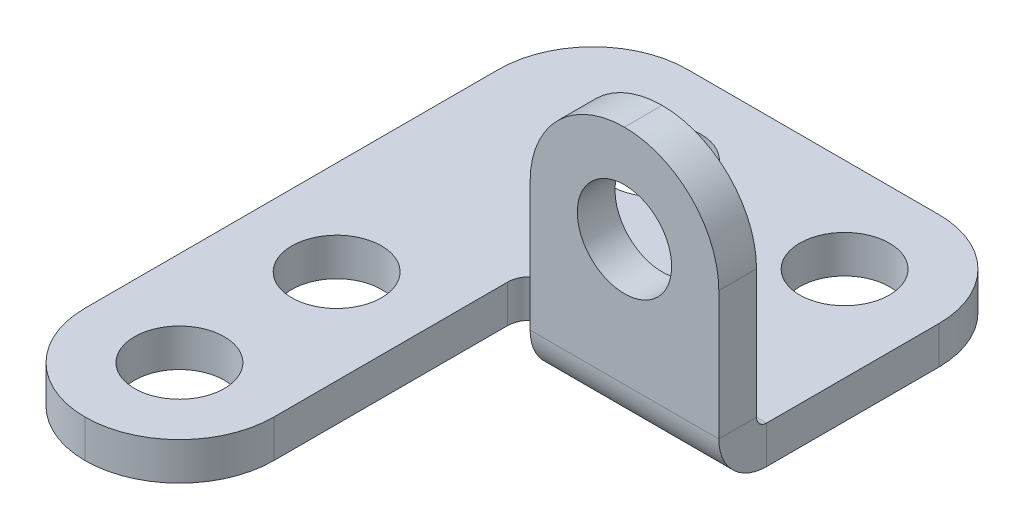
ISO-10303-21;
HEADER;
FILE_DESCRIPTION(('STEP AP214'),'2;1');
FILE_NAME('part.step','',(''),(''),'','','');
FILE_SCHEMA(('AUTOMOTIVE_DESIGN { 1 0 10303 214 1 1 1 1 }'));
ENDSEC;
DATA;
#1=APPLICATION_CONTEXT('core data for automotive mechanical design processes');
#2=APPLICATION_PROTOCOL_DEFINITION('international standard','automotive_design',2000,#1);
#3=PRODUCT_CONTEXT('',#1,'mechanical');
#4=PRODUCT('Part','Part','',(#3));
#5=PRODUCT_RELATED_PRODUCT_CATEGORY('part','',(#4));
#6=PRODUCT_DEFINITION_FORMATION('','',#4);
#7=PRODUCT_DEFINITION_CONTEXT('part definition',#1,'design');
#8=PRODUCT_DEFINITION('design','',#6,#7);
#9=PRODUCT_DEFINITION_SHAPE('','',#8);
#10=(LENGTH_UNIT() NAMED_UNIT(*) SI_UNIT(.MILLI.,.METRE.));
#11=(NAMED_UNIT(*) PLANE_ANGLE_UNIT() SI_UNIT($,.RADIAN.));
#12=(NAMED_UNIT(*) SI_UNIT($,.STERADIAN.) SOLID_ANGLE_UNIT());
#13=UNCERTAINTY_MEASURE_WITH_UNIT(LENGTH_MEASURE(1.E-05),#10,'distance_accuracy_value','');
#14=(GEOMETRIC_REPRESENTATION_CONTEXT(3) GLOBAL_UNCERTAINTY_ASSIGNED_CONTEXT((#13)) GLOBAL_UNIT_ASSIGNED_CONTEXT((#10,
#11,#12)) REPRESENTATION_CONTEXT('',''));
#15=CARTESIAN_POINT('',(0.,0.,0.));
#16=DIRECTION('',(0.,0.,1.));
#17=DIRECTION('',(1.,0.,0.));
#18=AXIS2_PLACEMENT_3D('',#15,#16,#17);
#19=CARTESIAN_POINT('',(0.,-1.905,0.));
#20=DIRECTION('',(0.,-1.,0.));
#21=DIRECTION('',(0.,0.,1.));
#22=AXIS2_PLACEMENT_3D('',#19,#20,#21);
#23=PLANE('',#22);
#24=CARTESIAN_POINT('',(4.7625,-1.905,25.6413));
#25=DIRECTION('',(0.,-1.,0.));
#26=DIRECTION('',(0.,0.,-1.));
#27=AXIS2_PLACEMENT_3D('',#24,#25,#26);
#28=CIRCLE('',#27,2.26695);
#29=CARTESIAN_POINT('',(4.7625,-1.905,23.37435));
#30=VERTEX_POINT('',#29);
#31=EDGE_CURVE('E268',#30,#30,#28,.T.);
#32=ORIENTED_EDGE('',*,*,#31,.F.);
#33=EDGE_LOOP('',(#32));
#34=FACE_BOUND('',#33,.T.);
#35=CARTESIAN_POINT('',(4.7625,-1.905,17.7038));
#36=DIRECTION('',(0.,-1.,0.));
#37=DIRECTION('',(0.,0.,-1.));
#38=AXIS2_PLACEMENT_3D('',#35,#36,#37);
#39=CIRCLE('',#38,2.26695);
#40=CARTESIAN_POINT('',(4.7625,-1.905,15.43685));
#41=VERTEX_POINT('',#40);
#42=EDGE_CURVE('E262',#41,#41,#39,.T.);
#43=ORIENTED_EDGE('',*,*,#42,.F.);
#44=EDGE_LOOP('',(#43));
#45=FACE_BOUND('',#44,.T.);
#46=CARTESIAN_POINT('',(17.4625,-1.905,4.7625));
#47=DIRECTION('',(0.,-1.,0.));
#48=DIRECTION('',(0.,0.,-1.));
#49=AXIS2_PLACEMENT_3D('',#46,#47,#48);
#50=CIRCLE('',#49,2.26695);
#51=CARTESIAN_POINT('',(17.4625,-1.905,2.49555));
#52=VERTEX_POINT('',#51);
#53=EDGE_CURVE('E256',#52,#52,#50,.T.);
#54=ORIENTED_EDGE('',*,*,#53,.F.);
#55=EDGE_LOOP('',(#54));
#56=FACE_BOUND('',#55,.T.);
#57=CARTESIAN_POINT('',(7.9375,-1.905,4.7625));
#58=DIRECTION('',(0.,-1.,0.));
#59=DIRECTION('',(0.,0.,-1.));
#60=AXIS2_PLACEMENT_3D('',#57,#58,#59);
#61=CIRCLE('',#60,2.26695);
#62=CARTESIAN_POINT('',(7.9375,-1.905,2.49555));
#63=VERTEX_POINT('',#62);
#64=EDGE_CURVE('E250',#63,#63,#61,.T.);
#65=ORIENTED_EDGE('',*,*,#64,.F.);
#66=EDGE_LOOP('',(#65));
#67=FACE_BOUND('',#66,.T.);
#68=CARTESIAN_POINT('',(11.557,-1.905,13.843));
#69=DIRECTION('',(0.,-1.,0.));
#70=DIRECTION('',(0.,0.,-1.));
#71=AXIS2_PLACEMENT_3D('',#68,#69,#70);
#72=CIRCLE('',#71,1.143);
#73=CARTESIAN_POINT('',(11.557,-1.905,12.7));
#74=VERTEX_POINT('',#73);
#75=CARTESIAN_POINT('',(12.690475,-1.905,13.6957470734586));
#76=VERTEX_POINT('',#75);
#77=EDGE_CURVE('E274',#74,#76,#72,.T.);
#78=ORIENTED_EDGE('',*,*,#77,.F.);
#79=DIRECTION('',(1.,0.,0.));
#80=VECTOR('',#79,1.);
#81=CARTESIAN_POINT('',(0.,-1.905,12.7));
#82=LINE('',#81,#80);
#83=CARTESIAN_POINT('',(10.668,-1.905,12.7));
#84=VERTEX_POINT('',#83);
#85=EDGE_CURVE('E278',#84,#74,#82,.T.);
#86=ORIENTED_EDGE('',*,*,#85,.F.);
#87=CARTESIAN_POINT('',(10.668,-1.905,13.843));
#88=DIRECTION('',(0.,-1.,0.));
#89=DIRECTION('',(0.,0.,-1.));
#90=AXIS2_PLACEMENT_3D('',#87,#88,#89);
#91=CIRCLE('',#90,1.143);
#92=CARTESIAN_POINT('',(9.525,-1.905,13.843));
#93=VERTEX_POINT('',#92);
#94=EDGE_CURVE('E281',#93,#84,#91,.T.);
#95=ORIENTED_EDGE('',*,*,#94,.F.);
#96=DIRECTION('',(0.,0.,1.));
#97=VECTOR('',#96,1.);
#98=CARTESIAN_POINT('',(9.525,-1.905,30.4038));
#99=LINE('',#98,#97);
#100=CARTESIAN_POINT('',(9.525,-1.905,25.6413));
#101=VERTEX_POINT('',#100);
#102=EDGE_CURVE('E309',#93,#101,#99,.T.);
#103=ORIENTED_EDGE('',*,*,#102,.T.);
#104=CARTESIAN_POINT('',(4.7625,-1.905,25.6413));
#105=DIRECTION('',(0.,1.,0.));
#106=DIRECTION('',(0.,0.,1.));
#107=AXIS2_PLACEMENT_3D('',#104,#105,#106);
#108=CIRCLE('',#107,4.7625);
#109=CARTESIAN_POINT('',(4.7625,-1.905,30.4038));
#110=VERTEX_POINT('',#109);
#111=EDGE_CURVE('E344',#110,#101,#108,.T.);
#112=ORIENTED_EDGE('',*,*,#111,.F.);
#113=CARTESIAN_POINT('',(4.7625,-1.905,25.6413));
#114=DIRECTION('',(0.,1.,0.));
#115=DIRECTION('',(0.,0.,1.));
#116=AXIS2_PLACEMENT_3D('',#113,#114,#115);
#117=CIRCLE('',#116,4.7625);
#118=CARTESIAN_POINT('',(0.,-1.905,25.6413));
#119=VERTEX_POINT('',#118);
#120=EDGE_CURVE('E347',#119,#110,#117,.T.);
#121=ORIENTED_EDGE('',*,*,#120,.F.);
#122=DIRECTION('',(0.,0.,-1.));
#123=VECTOR('',#122,1.);
#124=CARTESIAN_POINT('',(0.,-1.905,0.));
#125=LINE('',#124,#123);
#126=CARTESIAN_POINT('',(0.,-1.905,4.7625));
#127=VERTEX_POINT('',#126);
#128=EDGE_CURVE('E299',#119,#127,#125,.T.);
#129=ORIENTED_EDGE('',*,*,#128,.T.);
#130=CARTESIAN_POINT('',(4.7625,-1.905,4.7625));
#131=DIRECTION('',(0.,1.,0.));
#132=DIRECTION('',(0.,0.,1.));
#133=AXIS2_PLACEMENT_3D('',#130,#131,#132);
#134=CIRCLE('',#133,4.7625);
#135=CARTESIAN_POINT('',(4.7625,-1.905,0.));
#136=VERTEX_POINT('',#135);
#137=EDGE_CURVE('E338',#136,#127,#134,.T.);
#138=ORIENTED_EDGE('',*,*,#137,.F.);
#139=DIRECTION('',(1.,0.,0.));
#140=VECTOR('',#139,1.);
#141=CARTESIAN_POINT('',(0.,-1.905,0.));
#142=LINE('',#141,#140);
#143=CARTESIAN_POINT('',(17.4625,-1.905,0.));
#144=VERTEX_POINT('',#143);
#145=EDGE_CURVE('E302',#136,#144,#142,.T.);
#146=ORIENTED_EDGE('',*,*,#145,.T.);
#147=CARTESIAN_POINT('',(17.4625,-1.905,4.7625));
#148=DIRECTION('',(0.,1.,0.));
#149=DIRECTION('',(0.,0.,1.));
#150=AXIS2_PLACEMENT_3D('',#147,#148,#149);
#151=CIRCLE('',#150,4.7625);
#152=CARTESIAN_POINT('',(22.225,-1.905,4.7625));
#153=VERTEX_POINT('',#152);
#154=EDGE_CURVE('E341',#153,#144,#151,.T.);
#155=ORIENTED_EDGE('',*,*,#154,.F.);
#156=DIRECTION('',(0.,0.,1.));
#157=VECTOR('',#156,1.);
#158=CARTESIAN_POINT('',(22.225,-1.905,0.));
#159=LINE('',#158,#157);
#160=CARTESIAN_POINT('',(22.225,-1.905,13.462));
#161=VERTEX_POINT('',#160);
#162=EDGE_CURVE('E306',#153,#161,#159,.T.);
#163=ORIENTED_EDGE('',*,*,#162,.T.);
#164=DIRECTION('',(-1.,0.,0.));
#165=VECTOR('',#164,1.);
#166=CARTESIAN_POINT('',(12.7,-1.905,13.462));
#167=LINE('',#166,#165);
#168=CARTESIAN_POINT('',(12.7,-1.905,13.462));
#169=VERTEX_POINT('',#168);
#170=EDGE_CURVE('E212',#169,#161,#167,.F.);
#171=ORIENTED_EDGE('',*,*,#170,.F.);
#172=DIRECTION('',(0.,0.,1.));
#173=VECTOR('',#172,1.);
#174=CARTESIAN_POINT('',(12.7,-1.905,0.));
#175=LINE('',#174,#173);
#176=CARTESIAN_POINT('',(12.7,-1.905,13.452475));
#177=VERTEX_POINT('',#176);
#178=EDGE_CURVE('E244',#177,#169,#175,.T.);
#179=ORIENTED_EDGE('',*,*,#178,.F.);
#180=CARTESIAN_POINT('',(12.6952375,-1.905,13.452475));
#181=DIRECTION('',(0.,1.,0.));
#182=DIRECTION('',(0.,0.,1.));
#183=AXIS2_PLACEMENT_3D('',#180,#181,#182);
#184=CIRCLE('',#183,0.00476249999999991);
#185=CARTESIAN_POINT('',(12.690475,-1.905,13.452475));
#186=VERTEX_POINT('',#185);
#187=EDGE_CURVE('E246',#186,#177,#184,.F.);
#188=ORIENTED_EDGE('',*,*,#187,.F.);
#189=DIRECTION('',(0.,0.,-1.));
#190=VECTOR('',#189,1.);
#191=CARTESIAN_POINT('',(12.690475,-1.905,0.));
#192=LINE('',#191,#190);
#193=EDGE_CURVE('E232',#76,#186,#192,.T.);
#194=ORIENTED_EDGE('',*,*,#193,.F.);
#195=EDGE_LOOP('',(#78,#86,#95,#103,#112,#121,#129,#138,#146,#155,#163,#171,#179,#188,#194));
#196=FACE_BOUND('',#195,.T.);
#197=ADVANCED_FACE('F41',(#34,#45,#56,#67,#196),#23,.T.);
#198=CARTESIAN_POINT('',(0.,0.,0.));
#199=DIRECTION('',(0.,-1.,0.));
#200=DIRECTION('',(0.,0.,1.));
#201=AXIS2_PLACEMENT_3D('',#198,#199,#200);
#202=PLANE('',#201);
#203=CARTESIAN_POINT('',(4.7625,0.,25.6413));
#204=DIRECTION('',(0.,-1.,0.));
#205=DIRECTION('',(0.,0.,-1.));
#206=AXIS2_PLACEMENT_3D('',#203,#204,#205);
#207=CIRCLE('',#206,2.26695);
#208=CARTESIAN_POINT('',(4.7625,0.,23.37435));
#209=VERTEX_POINT('',#208);
#210=EDGE_CURVE('E265',#209,#209,#207,.T.);
#211=ORIENTED_EDGE('',*,*,#210,.T.);
#212=EDGE_LOOP('',(#211));
#213=FACE_BOUND('',#212,.T.);
#214=CARTESIAN_POINT('',(4.7625,0.,17.7038));
#215=DIRECTION('',(0.,-1.,0.));
#216=DIRECTION('',(0.,0.,-1.));
#217=AXIS2_PLACEMENT_3D('',#214,#215,#216);
#218=CIRCLE('',#217,2.26695);
#219=CARTESIAN_POINT('',(4.7625,0.,15.43685));
#220=VERTEX_POINT('',#219);
#221=EDGE_CURVE('E259',#220,#220,#218,.T.);
#222=ORIENTED_EDGE('',*,*,#221,.T.);
#223=EDGE_LOOP('',(#222));
#224=FACE_BOUND('',#223,.T.);
#225=CARTESIAN_POINT('',(17.4625,0.,4.7625));
#226=DIRECTION('',(0.,-1.,0.));
#227=DIRECTION('',(0.,0.,-1.));
#228=AXIS2_PLACEMENT_3D('',#225,#226,#227);
#229=CIRCLE('',#228,2.26695);
#230=CARTESIAN_POINT('',(17.4625,0.,2.49555));
#231=VERTEX_POINT('',#230);
#232=EDGE_CURVE('E253',#231,#231,#229,.T.);
#233=ORIENTED_EDGE('',*,*,#232,.T.);
#234=EDGE_LOOP('',(#233));
#235=FACE_BOUND('',#234,.T.);
#236=CARTESIAN_POINT('',(7.9375,0.,4.7625));
#237=DIRECTION('',(0.,-1.,0.));
#238=DIRECTION('',(0.,0.,-1.));
#239=AXIS2_PLACEMENT_3D('',#236,#237,#238);
#240=CIRCLE('',#239,2.26695);
#241=CARTESIAN_POINT('',(7.9375,0.,2.49555));
#242=VERTEX_POINT('',#241);
#243=EDGE_CURVE('E249',#242,#242,#240,.T.);
#244=ORIENTED_EDGE('',*,*,#243,.T.);
#245=EDGE_LOOP('',(#244));
#246=FACE_BOUND('',#245,.T.);
#247=DIRECTION('',(0.,0.,-1.));
#248=VECTOR('',#247,1.);
#249=CARTESIAN_POINT('',(12.690475,0.,15.875));
#250=LINE('',#249,#248);
#251=CARTESIAN_POINT('',(12.690475,0.,13.6957470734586));
#252=VERTEX_POINT('',#251);
#253=CARTESIAN_POINT('',(12.690475,0.,13.452475));
#254=VERTEX_POINT('',#253);
#255=EDGE_CURVE('E229',#252,#254,#250,.T.);
#256=ORIENTED_EDGE('',*,*,#255,.T.);
#257=CARTESIAN_POINT('',(12.6952375,0.,13.452475));
#258=DIRECTION('',(0.,-1.,0.));
#259=DIRECTION('',(0.,0.,-1.));
#260=AXIS2_PLACEMENT_3D('',#257,#258,#259);
#261=CIRCLE('',#260,0.00476249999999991);
#262=CARTESIAN_POINT('',(12.7,0.,13.452475));
#263=VERTEX_POINT('',#262);
#264=EDGE_CURVE('E233',#254,#263,#261,.T.);
#265=ORIENTED_EDGE('',*,*,#264,.T.);
#266=DIRECTION('',(0.,0.,1.));
#267=VECTOR('',#266,1.);
#268=CARTESIAN_POINT('',(12.7,0.,13.452475));
#269=LINE('',#268,#267);
#270=CARTESIAN_POINT('',(12.7,0.,13.462));
#271=VERTEX_POINT('',#270);
#272=EDGE_CURVE('E237',#263,#271,#269,.T.);
#273=ORIENTED_EDGE('',*,*,#272,.T.);
#274=DIRECTION('',(-1.,0.,0.));
#275=VECTOR('',#274,1.);
#276=CARTESIAN_POINT('',(12.7,0.,13.462));
#277=LINE('',#276,#275);
#278=CARTESIAN_POINT('',(22.225,0.,13.462));
#279=VERTEX_POINT('',#278);
#280=EDGE_CURVE('E217',#271,#279,#277,.F.);
#281=ORIENTED_EDGE('',*,*,#280,.T.);
#282=DIRECTION('',(0.,0.,1.));
#283=VECTOR('',#282,1.);
#284=CARTESIAN_POINT('',(22.225,0.,0.));
#285=LINE('',#284,#283);
#286=CARTESIAN_POINT('',(22.225,0.,4.7625));
#287=VERTEX_POINT('',#286);
#288=EDGE_CURVE('E318',#287,#279,#285,.T.);
#289=ORIENTED_EDGE('',*,*,#288,.F.);
#290=CARTESIAN_POINT('',(17.4625,0.,4.7625));
#291=DIRECTION('',(0.,1.,0.));
#292=DIRECTION('',(0.,0.,1.));
#293=AXIS2_PLACEMENT_3D('',#290,#291,#292);
#294=CIRCLE('',#293,4.7625);
#295=CARTESIAN_POINT('',(17.4625,0.,0.));
#296=VERTEX_POINT('',#295);
#297=EDGE_CURVE('E325',#296,#287,#294,.F.);
#298=ORIENTED_EDGE('',*,*,#297,.F.);
#299=DIRECTION('',(1.,0.,0.));
#300=VECTOR('',#299,1.);
#301=CARTESIAN_POINT('',(0.,0.,0.));
#302=LINE('',#301,#300);
#303=CARTESIAN_POINT('',(4.7625,0.,0.));
#304=VERTEX_POINT('',#303);
#305=EDGE_CURVE('E315',#304,#296,#302,.T.);
#306=ORIENTED_EDGE('',*,*,#305,.F.);
#307=CARTESIAN_POINT('',(4.7625,0.,4.7625));
#308=DIRECTION('',(0.,1.,0.));
#309=DIRECTION('',(0.,0.,1.));
#310=AXIS2_PLACEMENT_3D('',#307,#308,#309);
#311=CIRCLE('',#310,4.7625);
#312=CARTESIAN_POINT('',(0.,0.,4.7625));
#313=VERTEX_POINT('',#312);
#314=EDGE_CURVE('E312',#313,#304,#311,.F.);
#315=ORIENTED_EDGE('',*,*,#314,.F.);
#316=DIRECTION('',(0.,0.,-1.));
#317=VECTOR('',#316,1.);
#318=CARTESIAN_POINT('',(0.,0.,0.));
#319=LINE('',#318,#317);
#320=CARTESIAN_POINT('',(0.,0.,25.6413));
#321=VERTEX_POINT('',#320);
#322=EDGE_CURVE('E297',#321,#313,#319,.T.);
#323=ORIENTED_EDGE('',*,*,#322,.F.);
#324=CARTESIAN_POINT('',(4.7625,0.,25.6413));
#325=DIRECTION('',(0.,1.,0.));
#326=DIRECTION('',(0.,0.,1.));
#327=AXIS2_PLACEMENT_3D('',#324,#325,#326);
#328=CIRCLE('',#327,4.7625);
#329=CARTESIAN_POINT('',(4.7625,0.,30.4038));
#330=VERTEX_POINT('',#329);
#331=EDGE_CURVE('E331',#330,#321,#328,.F.);
#332=ORIENTED_EDGE('',*,*,#331,.F.);
#333=CARTESIAN_POINT('',(4.7625,0.,25.6413));
#334=DIRECTION('',(0.,1.,0.));
#335=DIRECTION('',(0.,0.,1.));
#336=AXIS2_PLACEMENT_3D('',#333,#334,#335);
#337=CIRCLE('',#336,4.7625);
#338=CARTESIAN_POINT('',(9.525,0.,25.6413));
#339=VERTEX_POINT('',#338);
#340=EDGE_CURVE('E328',#339,#330,#337,.F.);
#341=ORIENTED_EDGE('',*,*,#340,.F.);
#342=DIRECTION('',(0.,0.,1.));
#343=VECTOR('',#342,1.);
#344=CARTESIAN_POINT('',(9.525,0.,30.4038));
#345=LINE('',#344,#343);
#346=CARTESIAN_POINT('',(9.525,0.,13.843));
#347=VERTEX_POINT('',#346);
#348=EDGE_CURVE('E303',#347,#339,#345,.T.);
#349=ORIENTED_EDGE('',*,*,#348,.F.);
#350=CARTESIAN_POINT('',(10.668,0.,13.843));
#351=DIRECTION('',(0.,-1.,0.));
#352=DIRECTION('',(0.,0.,-1.));
#353=AXIS2_PLACEMENT_3D('',#350,#351,#352);
#354=CIRCLE('',#353,1.143);
#355=CARTESIAN_POINT('',(10.668,0.,12.7));
#356=VERTEX_POINT('',#355);
#357=EDGE_CURVE('E285',#347,#356,#354,.T.);
#358=ORIENTED_EDGE('',*,*,#357,.T.);
#359=DIRECTION('',(1.,0.,0.));
#360=VECTOR('',#359,1.);
#361=CARTESIAN_POINT('',(10.668,0.,12.7));
#362=LINE('',#361,#360);
#363=CARTESIAN_POINT('',(11.557,0.,12.7));
#364=VERTEX_POINT('',#363);
#365=EDGE_CURVE('E288',#356,#364,#362,.T.);
#366=ORIENTED_EDGE('',*,*,#365,.T.);
#367=CARTESIAN_POINT('',(11.557,0.,13.843));
#368=DIRECTION('',(0.,-1.,0.));
#369=DIRECTION('',(0.,0.,-1.));
#370=AXIS2_PLACEMENT_3D('',#367,#368,#369);
#371=CIRCLE('',#370,1.143);
#372=EDGE_CURVE('E284',#364,#252,#371,.T.);
#373=ORIENTED_EDGE('',*,*,#372,.T.);
#374=EDGE_LOOP('',(#256,#265,#273,#281,#289,#298,#306,#315,#323,#332,#341,#349,#358,#366,#373));
#375=FACE_BOUND('',#374,.T.);
#376=ADVANCED_FACE('F402',(#213,#224,#235,#246,#375),#202,.F.);
#377=CARTESIAN_POINT('',(11.557,0.,13.843));
#378=DIRECTION('',(0.,1.,0.));
#379=DIRECTION('',(0.,0.,-1.));
#380=AXIS2_PLACEMENT_3D('',#377,#378,#379);
#381=CYLINDRICAL_SURFACE('',#380,1.143);
#382=ORIENTED_EDGE('',*,*,#372,.F.);
#383=DIRECTION('',(0.,1.,0.));
#384=VECTOR('',#383,1.);
#385=CARTESIAN_POINT('',(11.557,0.,12.7));
#386=LINE('',#385,#384);
#387=EDGE_CURVE('E293',#364,#74,#386,.F.);
#388=ORIENTED_EDGE('',*,*,#387,.T.);
#389=ORIENTED_EDGE('',*,*,#77,.T.);
#390=DIRECTION('',(0.,1.,0.));
#391=VECTOR('',#390,1.);
#392=CARTESIAN_POINT('',(12.690475,0.,13.6957470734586));
#393=LINE('',#392,#391);
#394=EDGE_CURVE('E358',#252,#76,#393,.F.);
#395=ORIENTED_EDGE('',*,*,#394,.F.);
#396=EDGE_LOOP('',(#382,#388,#389,#395));
#397=FACE_BOUND('',#396,.T.);
#398=ADVANCED_FACE('F408',(#397),#381,.F.);
#399=CARTESIAN_POINT('',(0.,-1.905,0.));
#400=DIRECTION('',(-1.,0.,0.));
#401=DIRECTION('',(0.,0.,-1.));
#402=AXIS2_PLACEMENT_3D('',#399,#400,#401);
#403=PLANE('',#402);
#404=ORIENTED_EDGE('',*,*,#322,.T.);
#405=DIRECTION('',(0.,1.,0.));
#406=VECTOR('',#405,1.);
#407=CARTESIAN_POINT('',(0.,-1.905,4.7625));
#408=LINE('',#407,#406);
#409=EDGE_CURVE('E334',#127,#313,#408,.T.);
#410=ORIENTED_EDGE('',*,*,#409,.F.);
#411=ORIENTED_EDGE('',*,*,#128,.F.);
#412=DIRECTION('',(0.,1.,0.));
#413=VECTOR('',#412,1.);
#414=CARTESIAN_POINT('',(0.,-1.905,25.6413));
#415=LINE('',#414,#413);
#416=EDGE_CURVE('E336',#321,#119,#415,.F.);
#417=ORIENTED_EDGE('',*,*,#416,.F.);
#418=EDGE_LOOP('',(#404,#410,#411,#417));
#419=FACE_BOUND('',#418,.T.);
#420=ADVANCED_FACE('F421',(#419),#403,.T.);
#421=CARTESIAN_POINT('',(9.525,-1.905,30.4038));
#422=DIRECTION('',(1.,0.,0.));
#423=DIRECTION('',(0.,0.,1.));
#424=AXIS2_PLACEMENT_3D('',#421,#422,#423);
#425=PLANE('',#424);
#426=ORIENTED_EDGE('',*,*,#102,.F.);
#427=DIRECTION('',(0.,1.,0.));
#428=VECTOR('',#427,1.);
#429=CARTESIAN_POINT('',(9.525,0.,13.843));
#430=LINE('',#429,#428);
#431=EDGE_CURVE('E277',#347,#93,#430,.F.);
#432=ORIENTED_EDGE('',*,*,#431,.F.);
#433=ORIENTED_EDGE('',*,*,#348,.T.);
#434=DIRECTION('',(0.,1.,0.));
#435=VECTOR('',#434,1.);
#436=CARTESIAN_POINT('',(9.525,-1.905,25.6413));
#437=LINE('',#436,#435);
#438=EDGE_CURVE('E350',#101,#339,#437,.T.);
#439=ORIENTED_EDGE('',*,*,#438,.F.);
#440=EDGE_LOOP('',(#426,#432,#433,#439));
#441=FACE_BOUND('',#440,.T.);
#442=ADVANCED_FACE('F417',(#441),#425,.T.);
#443=CARTESIAN_POINT('',(22.225,-1.905,0.));
#444=DIRECTION('',(1.,0.,0.));
#445=DIRECTION('',(0.,0.,1.));
#446=AXIS2_PLACEMENT_3D('',#443,#444,#445);
#447=PLANE('',#446);
#448=DIRECTION('',(0.,-1.,0.));
#449=VECTOR('',#448,1.);
#450=CARTESIAN_POINT('',(22.225,0.,13.462));
#451=LINE('',#450,#449);
#452=EDGE_CURVE('E224',#279,#161,#451,.T.);
#453=ORIENTED_EDGE('',*,*,#452,.T.);
#454=ORIENTED_EDGE('',*,*,#162,.F.);
#455=DIRECTION('',(0.,1.,0.));
#456=VECTOR('',#455,1.);
#457=CARTESIAN_POINT('',(22.225,-1.905,4.7625));
#458=LINE('',#457,#456);
#459=EDGE_CURVE('E356',#287,#153,#458,.F.);
#460=ORIENTED_EDGE('',*,*,#459,.F.);
#461=ORIENTED_EDGE('',*,*,#288,.T.);
#462=EDGE_LOOP('',(#453,#454,#460,#461));
#463=FACE_BOUND('',#462,.T.);
#464=ADVANCED_FACE('F420',(#463),#447,.T.);
#465=CARTESIAN_POINT('',(0.,-1.905,0.));
#466=DIRECTION('',(0.,0.,-1.));
#467=DIRECTION('',(1.,0.,0.));
#468=AXIS2_PLACEMENT_3D('',#465,#466,#467);
#469=PLANE('',#468);
#470=ORIENTED_EDGE('',*,*,#145,.F.);
#471=DIRECTION('',(0.,1.,0.));
#472=VECTOR('',#471,1.);
#473=CARTESIAN_POINT('',(4.7625,-1.905,0.));
#474=LINE('',#473,#472);
#475=EDGE_CURVE('E352',#304,#136,#474,.F.);
#476=ORIENTED_EDGE('',*,*,#475,.F.);
#477=ORIENTED_EDGE('',*,*,#305,.T.);
#478=DIRECTION('',(0.,1.,0.));
#479=VECTOR('',#478,1.);
#480=CARTESIAN_POINT('',(17.4625,-1.905,0.));
#481=LINE('',#480,#479);
#482=EDGE_CURVE('E354',#144,#296,#481,.T.);
#483=ORIENTED_EDGE('',*,*,#482,.F.);
#484=EDGE_LOOP('',(#470,#476,#477,#483));
#485=FACE_BOUND('',#484,.T.);
#486=ADVANCED_FACE('F425',(#485),#469,.T.);
#487=CARTESIAN_POINT('',(10.668,0.,12.7));
#488=DIRECTION('',(0.,0.,1.));
#489=DIRECTION('',(1.,0.,0.));
#490=AXIS2_PLACEMENT_3D('',#487,#488,#489);
#491=PLANE('',#490);
#492=DIRECTION('',(0.,1.,0.));
#493=VECTOR('',#492,1.);
#494=CARTESIAN_POINT('',(10.668,0.,12.7));
#495=LINE('',#494,#493);
#496=EDGE_CURVE('E295',#356,#84,#495,.F.);
#497=ORIENTED_EDGE('',*,*,#496,.T.);
#498=ORIENTED_EDGE('',*,*,#85,.T.);
#499=ORIENTED_EDGE('',*,*,#387,.F.);
#500=ORIENTED_EDGE('',*,*,#365,.F.);
#501=EDGE_LOOP('',(#497,#498,#499,#500));
#502=FACE_BOUND('',#501,.T.);
#503=ADVANCED_FACE('F429',(#502),#491,.T.);
#504=CARTESIAN_POINT('',(10.668,0.,13.843));
#505=DIRECTION('',(0.,1.,0.));
#506=DIRECTION('',(0.,0.,-1.));
#507=AXIS2_PLACEMENT_3D('',#504,#505,#506);
#508=CYLINDRICAL_SURFACE('',#507,1.143);
#509=ORIENTED_EDGE('',*,*,#357,.F.);
#510=ORIENTED_EDGE('',*,*,#431,.T.);
#511=ORIENTED_EDGE('',*,*,#94,.T.);
#512=ORIENTED_EDGE('',*,*,#496,.F.);
#513=EDGE_LOOP('',(#509,#510,#511,#512));
#514=FACE_BOUND('',#513,.T.);
#515=ADVANCED_FACE('F414',(#514),#508,.F.);
#516=CARTESIAN_POINT('',(4.7625,-1.905,25.6413));
#517=DIRECTION('',(0.,1.,0.));
#518=DIRECTION('',(0.,0.,-1.));
#519=AXIS2_PLACEMENT_3D('',#516,#517,#518);
#520=CYLINDRICAL_SURFACE('',#519,4.7625);
#521=ORIENTED_EDGE('',*,*,#438,.T.);
#522=ORIENTED_EDGE('',*,*,#340,.T.);
#523=DIRECTION('',(0.,1.,0.));
#524=VECTOR('',#523,1.);
#525=CARTESIAN_POINT('',(4.7625,-1.905,30.4038));
#526=LINE('',#525,#524);
#527=EDGE_CURVE('E271',#330,#110,#526,.F.);
#528=ORIENTED_EDGE('',*,*,#527,.T.);
#529=ORIENTED_EDGE('',*,*,#111,.T.);
#530=EDGE_LOOP('',(#521,#522,#528,#529));
#531=FACE_BOUND('',#530,.T.);
#532=ADVANCED_FACE('F438',(#531),#520,.T.);
#533=CARTESIAN_POINT('',(4.7625,-1.905,25.6413));
#534=DIRECTION('',(0.,1.,0.));
#535=DIRECTION('',(0.,0.,-1.));
#536=AXIS2_PLACEMENT_3D('',#533,#534,#535);
#537=CYLINDRICAL_SURFACE('',#536,4.7625);
#538=ORIENTED_EDGE('',*,*,#120,.T.);
#539=ORIENTED_EDGE('',*,*,#527,.F.);
#540=ORIENTED_EDGE('',*,*,#331,.T.);
#541=ORIENTED_EDGE('',*,*,#416,.T.);
#542=EDGE_LOOP('',(#538,#539,#540,#541));
#543=FACE_BOUND('',#542,.T.);
#544=ADVANCED_FACE('F434',(#543),#537,.T.);
#545=CARTESIAN_POINT('',(17.4625,-1.905,4.7625));
#546=DIRECTION('',(0.,1.,0.));
#547=DIRECTION('',(0.,0.,-1.));
#548=AXIS2_PLACEMENT_3D('',#545,#546,#547);
#549=CYLINDRICAL_SURFACE('',#548,4.7625);
#550=ORIENTED_EDGE('',*,*,#154,.T.);
#551=ORIENTED_EDGE('',*,*,#482,.T.);
#552=ORIENTED_EDGE('',*,*,#297,.T.);
#553=ORIENTED_EDGE('',*,*,#459,.T.);
#554=EDGE_LOOP('',(#550,#551,#552,#553));
#555=FACE_BOUND('',#554,.T.);
#556=ADVANCED_FACE('F437',(#555),#549,.T.);
#557=CARTESIAN_POINT('',(4.7625,-1.905,4.7625));
#558=DIRECTION('',(0.,1.,0.));
#559=DIRECTION('',(0.,0.,-1.));
#560=AXIS2_PLACEMENT_3D('',#557,#558,#559);
#561=CYLINDRICAL_SURFACE('',#560,4.7625);
#562=ORIENTED_EDGE('',*,*,#137,.T.);
#563=ORIENTED_EDGE('',*,*,#409,.T.);
#564=ORIENTED_EDGE('',*,*,#314,.T.);
#565=ORIENTED_EDGE('',*,*,#475,.T.);
#566=EDGE_LOOP('',(#562,#563,#564,#565));
#567=FACE_BOUND('',#566,.T.);
#568=ADVANCED_FACE('F445',(#567),#561,.T.);
#569=CARTESIAN_POINT('',(4.7625,-1.905,25.6413));
#570=DIRECTION('',(0.,1.,0.));
#571=DIRECTION('',(0.,0.,-1.));
#572=AXIS2_PLACEMENT_3D('',#569,#570,#571);
#573=CYLINDRICAL_SURFACE('',#572,2.26695);
#574=CARTESIAN_POINT('',(4.7625,-1.905,23.37435));
#575=CARTESIAN_POINT('',(4.7625,-1.88515625,23.37435));
#576=CARTESIAN_POINT('',(4.7625,-1.8653125,23.37435));
#577=CARTESIAN_POINT('',(4.7625,-1.825625,23.37435));
#578=CARTESIAN_POINT('',(4.7625,-1.80578125,23.37435));
#579=CARTESIAN_POINT('',(4.7625,-1.76609375,23.37435));
#580=CARTESIAN_POINT('',(4.7625,-1.74625,23.37435));
#581=CARTESIAN_POINT('',(4.7625,-1.7065625,23.37435));
#582=CARTESIAN_POINT('',(4.7625,-1.68671875,23.37435));
#583=CARTESIAN_POINT('',(4.7625,-1.64703125,23.37435));
#584=CARTESIAN_POINT('',(4.7625,-1.6271875,23.37435));
#585=CARTESIAN_POINT('',(4.7625,-1.5875,23.37435));
#586=CARTESIAN_POINT('',(4.7625,-1.56765625,23.37435));
#587=CARTESIAN_POINT('',(4.7625,-1.52796875,23.37435));
#588=CARTESIAN_POINT('',(4.7625,-1.508125,23.37435));
#589=CARTESIAN_POINT('',(4.7625,-1.4684375,23.37435));
#590=CARTESIAN_POINT('',(4.7625,-1.44859375,23.37435));
#591=CARTESIAN_POINT('',(4.7625,-1.40890625,23.37435));
#592=CARTESIAN_POINT('',(4.7625,-1.3890625,23.37435));
#593=CARTESIAN_POINT('',(4.7625,-1.349375,23.37435));
#594=CARTESIAN_POINT('',(4.7625,-1.32953125,23.37435));
#595=CARTESIAN_POINT('',(4.7625,-1.28984375,23.37435));
#596=CARTESIAN_POINT('',(4.7625,-1.27,23.37435));
#597=CARTESIAN_POINT('',(4.7625,-1.2303125,23.37435));
#598=CARTESIAN_POINT('',(4.7625,-1.21046875,23.37435));
#599=CARTESIAN_POINT('',(4.7625,-1.17078125,23.37435));
#600=CARTESIAN_POINT('',(4.7625,-1.1509375,23.37435));
#601=CARTESIAN_POINT('',(4.7625,-1.11125,23.37435));
#602=CARTESIAN_POINT('',(4.7625,-1.09140625,23.37435));
#603=CARTESIAN_POINT('',(4.7625,-1.05171875,23.37435));
#604=CARTESIAN_POINT('',(4.7625,-1.031875,23.37435));
#605=CARTESIAN_POINT('',(4.7625,-0.9921875,23.37435));
#606=CARTESIAN_POINT('',(4.7625,-0.97234375,23.37435));
#607=CARTESIAN_POINT('',(4.7625,-0.93265625,23.37435));
#608=CARTESIAN_POINT('',(4.7625,-0.9128125,23.37435));
#609=CARTESIAN_POINT('',(4.7625,-0.873125,23.37435));
#610=CARTESIAN_POINT('',(4.7625,-0.85328125,23.37435));
#611=CARTESIAN_POINT('',(4.7625,-0.81359375,23.37435));
#612=CARTESIAN_POINT('',(4.7625,-0.79375,23.37435));
#613=CARTESIAN_POINT('',(4.7625,-0.7540625,23.37435));
#614=CARTESIAN_POINT('',(4.7625,-0.73421875,23.37435));
#615=CARTESIAN_POINT('',(4.7625,-0.69453125,23.37435));
#616=CARTESIAN_POINT('',(4.7625,-0.6746875,23.37435));
#617=CARTESIAN_POINT('',(4.7625,-0.635,23.37435));
#618=CARTESIAN_POINT('',(4.7625,-0.61515625,23.37435));
#619=CARTESIAN_POINT('',(4.7625,-0.57546875,23.37435));
#620=CARTESIAN_POINT('',(4.7625,-0.555625,23.37435));
#621=CARTESIAN_POINT('',(4.7625,-0.5159375,23.37435));
#622=CARTESIAN_POINT('',(4.7625,-0.49609375,23.37435));
#623=CARTESIAN_POINT('',(4.7625,-0.45640625,23.37435));
#624=CARTESIAN_POINT('',(4.7625,-0.4365625,23.37435));
#625=CARTESIAN_POINT('',(4.7625,-0.396875,23.37435));
#626=CARTESIAN_POINT('',(4.7625,-0.37703125,23.37435));
#627=CARTESIAN_POINT('',(4.7625,-0.33734375,23.37435));
#628=CARTESIAN_POINT('',(4.7625,-0.3175,23.37435));
#629=CARTESIAN_POINT('',(4.7625,-0.2778125,23.37435));
#630=CARTESIAN_POINT('',(4.7625,-0.25796875,23.37435));
#631=CARTESIAN_POINT('',(4.7625,-0.21828125,23.37435));
#632=CARTESIAN_POINT('',(4.7625,-0.1984375,23.37435));
#633=CARTESIAN_POINT('',(4.7625,-0.15875,23.37435));
#634=CARTESIAN_POINT('',(4.7625,-0.13890625,23.37435));
#635=CARTESIAN_POINT('',(4.7625,-0.09921875,23.37435));
#636=CARTESIAN_POINT('',(4.7625,-0.0793749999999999,23.37435));
#637=CARTESIAN_POINT('',(4.7625,-0.0396874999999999,23.37435));
#638=CARTESIAN_POINT('',(4.7625,-0.01984375,23.37435));
#639=CARTESIAN_POINT('',(4.7625,0.,23.37435));
#640=B_SPLINE_CURVE_WITH_KNOTS('',3,(#574,#575,#576,#577,#578,#579,#580,#581,#582,#583,#584,
#585,#586,#587,#588,#589,#590,#591,#592,#593,#594,#595,#596,#597,#598,#599,#600,#601,#602,#603,
#604,#605,#606,#607,#608,#609,#610,#611,#612,#613,#614,#615,#616,#617,#618,#619,#620,#621,#622,
#623,#624,#625,#626,#627,#628,#629,#630,#631,#632,#633,#634,#635,#636,#637,#638,#639),
.UNSPECIFIED.,.F.,.F.,(4,2,2,2,2,2,2,2,2,2,2,2,2,2,2,2,2,2,2,2,2,2,2,2,2,2,2,2,2,2,2,2,4),(0.,
0.0595312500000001,0.1190625,0.17859375,0.238125,0.29765625,0.3571875,0.41671875,0.47625,
0.53578125,0.5953125,0.65484375,0.714375,0.77390625,0.8334375,0.89296875,0.9525,1.01203125,
1.0715625,1.13109375,1.190625,1.25015625,1.3096875,1.36921875,1.42875,1.48828125,1.5478125,
1.60734375,1.666875,1.72640625,1.7859375,1.84546875,1.905),.UNSPECIFIED.);
#641=EDGE_CURVE('BSEAM448',#30,#209,#640,.T.);
#642=ORIENTED_EDGE('',*,*,#31,.T.);
#643=ORIENTED_EDGE('',*,*,#210,.F.);
#644=ORIENTED_EDGE('',*,*,#641,.T.);
#645=ORIENTED_EDGE('',*,*,#641,.F.);
#646=EDGE_LOOP('',(#642,#644,#643,#645));
#647=FACE_BOUND('',#646,.T.);
#648=ADVANCED_FACE('F448',(#647),#573,.F.);
#649=CARTESIAN_POINT('',(4.7625,-1.905,17.7038));
#650=DIRECTION('',(0.,1.,0.));
#651=DIRECTION('',(0.,0.,-1.));
#652=AXIS2_PLACEMENT_3D('',#649,#650,#651);
#653=CYLINDRICAL_SURFACE('',#652,2.26695);
#654=CARTESIAN_POINT('',(4.7625,-1.905,15.43685));
#655=CARTESIAN_POINT('',(4.7625,-1.88515625,15.43685));
#656=CARTESIAN_POINT('',(4.7625,-1.8653125,15.43685));
#657=CARTESIAN_POINT('',(4.7625,-1.825625,15.43685));
#658=CARTESIAN_POINT('',(4.7625,-1.80578125,15.43685));
#659=CARTESIAN_POINT('',(4.7625,-1.76609375,15.43685));
#660=CARTESIAN_POINT('',(4.7625,-1.74625,15.43685));
#661=CARTESIAN_POINT('',(4.7625,-1.7065625,15.43685));
#662=CARTESIAN_POINT('',(4.7625,-1.68671875,15.43685));
#663=CARTESIAN_POINT('',(4.7625,-1.64703125,15.43685));
#664=CARTESIAN_POINT('',(4.7625,-1.6271875,15.43685));
#665=CARTESIAN_POINT('',(4.7625,-1.5875,15.43685));
#666=CARTESIAN_POINT('',(4.7625,-1.56765625,15.43685));
#667=CARTESIAN_POINT('',(4.7625,-1.52796875,15.43685));
#668=CARTESIAN_POINT('',(4.7625,-1.508125,15.43685));
#669=CARTESIAN_POINT('',(4.7625,-1.4684375,15.43685));
#670=CARTESIAN_POINT('',(4.7625,-1.44859375,15.43685));
#671=CARTESIAN_POINT('',(4.7625,-1.40890625,15.43685));
#672=CARTESIAN_POINT('',(4.7625,-1.3890625,15.43685));
#673=CARTESIAN_POINT('',(4.7625,-1.349375,15.43685));
#674=CARTESIAN_POINT('',(4.7625,-1.32953125,15.43685));
#675=CARTESIAN_POINT('',(4.7625,-1.28984375,15.43685));
#676=CARTESIAN_POINT('',(4.7625,-1.27,15.43685));
#677=CARTESIAN_POINT('',(4.7625,-1.2303125,15.43685));
#678=CARTESIAN_POINT('',(4.7625,-1.21046875,15.43685));
#679=CARTESIAN_POINT('',(4.7625,-1.17078125,15.43685));
#680=CARTESIAN_POINT('',(4.7625,-1.1509375,15.43685));
#681=CARTESIAN_POINT('',(4.7625,-1.11125,15.43685));
#682=CARTESIAN_POINT('',(4.7625,-1.09140625,15.43685));
#683=CARTESIAN_POINT('',(4.7625,-1.05171875,15.43685));
#684=CARTESIAN_POINT('',(4.7625,-1.031875,15.43685));
#685=CARTESIAN_POINT('',(4.7625,-0.9921875,15.43685));
#686=CARTESIAN_POINT('',(4.7625,-0.97234375,15.43685));
#687=CARTESIAN_POINT('',(4.7625,-0.93265625,15.43685));
#688=CARTESIAN_POINT('',(4.7625,-0.9128125,15.43685));
#689=CARTESIAN_POINT('',(4.7625,-0.873125,15.43685));
#690=CARTESIAN_POINT('',(4.7625,-0.85328125,15.43685));
#691=CARTESIAN_POINT('',(4.7625,-0.81359375,15.43685));
#692=CARTESIAN_POINT('',(4.7625,-0.79375,15.43685));
#693=CARTESIAN_POINT('',(4.7625,-0.7540625,15.43685));
#694=CARTESIAN_POINT('',(4.7625,-0.73421875,15.43685));
#695=CARTESIAN_POINT('',(4.7625,-0.69453125,15.43685));
#696=CARTESIAN_POINT('',(4.7625,-0.6746875,15.43685));
#697=CARTESIAN_POINT('',(4.7625,-0.635,15.43685));
#698=CARTESIAN_POINT('',(4.7625,-0.61515625,15.43685));
#699=CARTESIAN_POINT('',(4.7625,-0.57546875,15.43685));
#700=CARTESIAN_POINT('',(4.7625,-0.555625,15.43685));
#701=CARTESIAN_POINT('',(4.7625,-0.5159375,15.43685));
#702=CARTESIAN_POINT('',(4.7625,-0.49609375,15.43685));
#703=CARTESIAN_POINT('',(4.7625,-0.45640625,15.43685));
#704=CARTESIAN_POINT('',(4.7625,-0.4365625,15.43685));
#705=CARTESIAN_POINT('',(4.7625,-0.396875,15.43685));
#706=CARTESIAN_POINT('',(4.7625,-0.37703125,15.43685));
#707=CARTESIAN_POINT('',(4.7625,-0.33734375,15.43685));
#708=CARTESIAN_POINT('',(4.7625,-0.3175,15.43685));
#709=CARTESIAN_POINT('',(4.7625,-0.2778125,15.43685));
#710=CARTESIAN_POINT('',(4.7625,-0.25796875,15.43685));
#711=CARTESIAN_POINT('',(4.7625,-0.21828125,15.43685));
#712=CARTESIAN_POINT('',(4.7625,-0.1984375,15.43685));
#713=CARTESIAN_POINT('',(4.7625,-0.15875,15.43685));
#714=CARTESIAN_POINT('',(4.7625,-0.13890625,15.43685));
#715=CARTESIAN_POINT('',(4.7625,-0.09921875,15.43685));
#716=CARTESIAN_POINT('',(4.7625,-0.0793749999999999,15.43685));
#717=CARTESIAN_POINT('',(4.7625,-0.0396874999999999,15.43685));
#718=CARTESIAN_POINT('',(4.7625,-0.01984375,15.43685));
#719=CARTESIAN_POINT('',(4.7625,0.,15.43685));
#720=B_SPLINE_CURVE_WITH_KNOTS('',3,(#654,#655,#656,#657,#658,#659,#660,#661,#662,#663,#664,
#665,#666,#667,#668,#669,#670,#671,#672,#673,#674,#675,#676,#677,#678,#679,#680,#681,#682,#683,
#684,#685,#686,#687,#688,#689,#690,#691,#692,#693,#694,#695,#696,#697,#698,#699,#700,#701,#702,
#703,#704,#705,#706,#707,#708,#709,#710,#711,#712,#713,#714,#715,#716,#717,#718,#719),
.UNSPECIFIED.,.F.,.F.,(4,2,2,2,2,2,2,2,2,2,2,2,2,2,2,2,2,2,2,2,2,2,2,2,2,2,2,2,2,2,2,2,4),(0.,
0.0595312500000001,0.1190625,0.17859375,0.238125,0.29765625,0.3571875,0.41671875,0.47625,
0.53578125,0.5953125,0.65484375,0.714375,0.77390625,0.8334375,0.89296875,0.9525,1.01203125,
1.0715625,1.13109375,1.190625,1.25015625,1.3096875,1.36921875,1.42875,1.48828125,1.5478125,
1.60734375,1.666875,1.72640625,1.7859375,1.84546875,1.905),.UNSPECIFIED.);
#721=EDGE_CURVE('BSEAM453',#41,#220,#720,.T.);
#722=ORIENTED_EDGE('',*,*,#42,.T.);
#723=ORIENTED_EDGE('',*,*,#221,.F.);
#724=ORIENTED_EDGE('',*,*,#721,.T.);
#725=ORIENTED_EDGE('',*,*,#721,.F.);
#726=EDGE_LOOP('',(#722,#724,#723,#725));
#727=FACE_BOUND('',#726,.T.);
#728=ADVANCED_FACE('F453',(#727),#653,.F.);
#729=CARTESIAN_POINT('',(17.4625,-1.905,4.7625));
#730=DIRECTION('',(0.,1.,0.));
#731=DIRECTION('',(0.,0.,-1.));
#732=AXIS2_PLACEMENT_3D('',#729,#730,#731);
#733=CYLINDRICAL_SURFACE('',#732,2.26695);
#734=CARTESIAN_POINT('',(17.4625,-1.905,2.49555));
#735=CARTESIAN_POINT('',(17.4625,-1.88515625,2.49555));
#736=CARTESIAN_POINT('',(17.4625,-1.8653125,2.49555));
#737=CARTESIAN_POINT('',(17.4625,-1.825625,2.49555));
#738=CARTESIAN_POINT('',(17.4625,-1.80578125,2.49555));
#739=CARTESIAN_POINT('',(17.4625,-1.76609375,2.49555));
#740=CARTESIAN_POINT('',(17.4625,-1.74625,2.49555));
#741=CARTESIAN_POINT('',(17.4625,-1.7065625,2.49555));
#742=CARTESIAN_POINT('',(17.4625,-1.68671875,2.49555));
#743=CARTESIAN_POINT('',(17.4625,-1.64703125,2.49555));
#744=CARTESIAN_POINT('',(17.4625,-1.6271875,2.49555));
#745=CARTESIAN_POINT('',(17.4625,-1.5875,2.49555));
#746=CARTESIAN_POINT('',(17.4625,-1.56765625,2.49555));
#747=CARTESIAN_POINT('',(17.4625,-1.52796875,2.49555));
#748=CARTESIAN_POINT('',(17.4625,-1.508125,2.49555));
#749=CARTESIAN_POINT('',(17.4625,-1.4684375,2.49555));
#750=CARTESIAN_POINT('',(17.4625,-1.44859375,2.49555));
#751=CARTESIAN_POINT('',(17.4625,-1.40890625,2.49555));
#752=CARTESIAN_POINT('',(17.4625,-1.3890625,2.49555));
#753=CARTESIAN_POINT('',(17.4625,-1.349375,2.49555));
#754=CARTESIAN_POINT('',(17.4625,-1.32953125,2.49555));
#755=CARTESIAN_POINT('',(17.4625,-1.28984375,2.49555));
#756=CARTESIAN_POINT('',(17.4625,-1.27,2.49555));
#757=CARTESIAN_POINT('',(17.4625,-1.2303125,2.49555));
#758=CARTESIAN_POINT('',(17.4625,-1.21046875,2.49555));
#759=CARTESIAN_POINT('',(17.4625,-1.17078125,2.49555));
#760=CARTESIAN_POINT('',(17.4625,-1.1509375,2.49555));
#761=CARTESIAN_POINT('',(17.4625,-1.11125,2.49555));
#762=CARTESIAN_POINT('',(17.4625,-1.09140625,2.49555));
#763=CARTESIAN_POINT('',(17.4625,-1.05171875,2.49555));
#764=CARTESIAN_POINT('',(17.4625,-1.031875,2.49555));
#765=CARTESIAN_POINT('',(17.4625,-0.9921875,2.49555));
#766=CARTESIAN_POINT('',(17.4625,-0.97234375,2.49555));
#767=CARTESIAN_POINT('',(17.4625,-0.93265625,2.49555));
#768=CARTESIAN_POINT('',(17.4625,-0.9128125,2.49555));
#769=CARTESIAN_POINT('',(17.4625,-0.873125,2.49555));
#770=CARTESIAN_POINT('',(17.4625,-0.85328125,2.49555));
#771=CARTESIAN_POINT('',(17.4625,-0.81359375,2.49555));
#772=CARTESIAN_POINT('',(17.4625,-0.79375,2.49555));
#773=CARTESIAN_POINT('',(17.4625,-0.7540625,2.49555));
#774=CARTESIAN_POINT('',(17.4625,-0.73421875,2.49555));
#775=CARTESIAN_POINT('',(17.4625,-0.69453125,2.49555));
#776=CARTESIAN_POINT('',(17.4625,-0.6746875,2.49555));
#777=CARTESIAN_POINT('',(17.4625,-0.635,2.49555));
#778=CARTESIAN_POINT('',(17.4625,-0.61515625,2.49555));
#779=CARTESIAN_POINT('',(17.4625,-0.57546875,2.49555));
#780=CARTESIAN_POINT('',(17.4625,-0.555625,2.49555));
#781=CARTESIAN_POINT('',(17.4625,-0.5159375,2.49555));
#782=CARTESIAN_POINT('',(17.4625,-0.49609375,2.49555));
#783=CARTESIAN_POINT('',(17.4625,-0.45640625,2.49555));
#784=CARTESIAN_POINT('',(17.4625,-0.4365625,2.49555));
#785=CARTESIAN_POINT('',(17.4625,-0.396875,2.49555));
#786=CARTESIAN_POINT('',(17.4625,-0.37703125,2.49555));
#787=CARTESIAN_POINT('',(17.4625,-0.33734375,2.49555));
#788=CARTESIAN_POINT('',(17.4625,-0.3175,2.49555));
#789=CARTESIAN_POINT('',(17.4625,-0.2778125,2.49555));
#790=CARTESIAN_POINT('',(17.4625,-0.25796875,2.49555));
#791=CARTESIAN_POINT('',(17.4625,-0.21828125,2.49555));
#792=CARTESIAN_POINT('',(17.4625,-0.1984375,2.49555));
#793=CARTESIAN_POINT('',(17.4625,-0.15875,2.49555));
#794=CARTESIAN_POINT('',(17.4625,-0.13890625,2.49555));
#795=CARTESIAN_POINT('',(17.4625,-0.09921875,2.49555));
#796=CARTESIAN_POINT('',(17.4625,-0.0793749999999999,2.49555));
#797=CARTESIAN_POINT('',(17.4625,-0.0396874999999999,2.49555));
#798=CARTESIAN_POINT('',(17.4625,-0.01984375,2.49555));
#799=CARTESIAN_POINT('',(17.4625,0.,2.49555));
#800=B_SPLINE_CURVE_WITH_KNOTS('',3,(#734,#735,#736,#737,#738,#739,#740,#741,#742,#743,#744,
#745,#746,#747,#748,#749,#750,#751,#752,#753,#754,#755,#756,#757,#758,#759,#760,#761,#762,#763,
#764,#765,#766,#767,#768,#769,#770,#771,#772,#773,#774,#775,#776,#777,#778,#779,#780,#781,#782,
#783,#784,#785,#786,#787,#788,#789,#790,#791,#792,#793,#794,#795,#796,#797,#798,#799),
.UNSPECIFIED.,.F.,.F.,(4,2,2,2,2,2,2,2,2,2,2,2,2,2,2,2,2,2,2,2,2,2,2,2,2,2,2,2,2,2,2,2,4),(0.,
0.0595312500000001,0.1190625,0.17859375,0.238125,0.29765625,0.3571875,0.41671875,0.47625,
0.53578125,0.5953125,0.65484375,0.714375,0.77390625,0.8334375,0.89296875,0.9525,1.01203125,
1.0715625,1.13109375,1.190625,1.25015625,1.3096875,1.36921875,1.42875,1.48828125,1.5478125,
1.60734375,1.666875,1.72640625,1.7859375,1.84546875,1.905),.UNSPECIFIED.);
#801=EDGE_CURVE('BSEAM520',#52,#231,#800,.T.);
#802=ORIENTED_EDGE('',*,*,#53,.T.);
#803=ORIENTED_EDGE('',*,*,#232,.F.);
#804=ORIENTED_EDGE('',*,*,#801,.T.);
#805=ORIENTED_EDGE('',*,*,#801,.F.);
#806=EDGE_LOOP('',(#802,#804,#803,#805));
#807=FACE_BOUND('',#806,.T.);
#808=ADVANCED_FACE('F520',(#807),#733,.F.);
#809=CARTESIAN_POINT('',(7.9375,-1.905,4.7625));
#810=DIRECTION('',(0.,1.,0.));
#811=DIRECTION('',(0.,0.,-1.));
#812=AXIS2_PLACEMENT_3D('',#809,#810,#811);
#813=CYLINDRICAL_SURFACE('',#812,2.26695);
#814=CARTESIAN_POINT('',(7.9375,-1.905,2.49555));
#815=CARTESIAN_POINT('',(7.9375,-1.88515625,2.49555));
#816=CARTESIAN_POINT('',(7.9375,-1.8653125,2.49555));
#817=CARTESIAN_POINT('',(7.9375,-1.825625,2.49555));
#818=CARTESIAN_POINT('',(7.9375,-1.80578125,2.49555));
#819=CARTESIAN_POINT('',(7.9375,-1.76609375,2.49555));
#820=CARTESIAN_POINT('',(7.9375,-1.74625,2.49555));
#821=CARTESIAN_POINT('',(7.9375,-1.7065625,2.49555));
#822=CARTESIAN_POINT('',(7.9375,-1.68671875,2.49555));
#823=CARTESIAN_POINT('',(7.9375,-1.64703125,2.49555));
#824=CARTESIAN_POINT('',(7.9375,-1.6271875,2.49555));
#825=CARTESIAN_POINT('',(7.9375,-1.5875,2.49555));
#826=CARTESIAN_POINT('',(7.9375,-1.56765625,2.49555));
#827=CARTESIAN_POINT('',(7.9375,-1.52796875,2.49555));
#828=CARTESIAN_POINT('',(7.9375,-1.508125,2.49555));
#829=CARTESIAN_POINT('',(7.9375,-1.4684375,2.49555));
#830=CARTESIAN_POINT('',(7.9375,-1.44859375,2.49555));
#831=CARTESIAN_POINT('',(7.9375,-1.40890625,2.49555));
#832=CARTESIAN_POINT('',(7.9375,-1.3890625,2.49555));
#833=CARTESIAN_POINT('',(7.9375,-1.349375,2.49555));
#834=CARTESIAN_POINT('',(7.9375,-1.32953125,2.49555));
#835=CARTESIAN_POINT('',(7.9375,-1.28984375,2.49555));
#836=CARTESIAN_POINT('',(7.9375,-1.27,2.49555));
#837=CARTESIAN_POINT('',(7.9375,-1.2303125,2.49555));
#838=CARTESIAN_POINT('',(7.9375,-1.21046875,2.49555));
#839=CARTESIAN_POINT('',(7.9375,-1.17078125,2.49555));
#840=CARTESIAN_POINT('',(7.9375,-1.1509375,2.49555));
#841=CARTESIAN_POINT('',(7.9375,-1.11125,2.49555));
#842=CARTESIAN_POINT('',(7.9375,-1.09140625,2.49555));
#843=CARTESIAN_POINT('',(7.9375,-1.05171875,2.49555));
#844=CARTESIAN_POINT('',(7.9375,-1.031875,2.49555));
#845=CARTESIAN_POINT('',(7.9375,-0.9921875,2.49555));
#846=CARTESIAN_POINT('',(7.9375,-0.97234375,2.49555));
#847=CARTESIAN_POINT('',(7.9375,-0.93265625,2.49555));
#848=CARTESIAN_POINT('',(7.9375,-0.9128125,2.49555));
#849=CARTESIAN_POINT('',(7.9375,-0.873125,2.49555));
#850=CARTESIAN_POINT('',(7.9375,-0.85328125,2.49555));
#851=CARTESIAN_POINT('',(7.9375,-0.81359375,2.49555));
#852=CARTESIAN_POINT('',(7.9375,-0.79375,2.49555));
#853=CARTESIAN_POINT('',(7.9375,-0.7540625,2.49555));
#854=CARTESIAN_POINT('',(7.9375,-0.73421875,2.49555));
#855=CARTESIAN_POINT('',(7.9375,-0.69453125,2.49555));
#856=CARTESIAN_POINT('',(7.9375,-0.6746875,2.49555));
#857=CARTESIAN_POINT('',(7.9375,-0.635,2.49555));
#858=CARTESIAN_POINT('',(7.9375,-0.61515625,2.49555));
#859=CARTESIAN_POINT('',(7.9375,-0.57546875,2.49555));
#860=CARTESIAN_POINT('',(7.9375,-0.555625,2.49555));
#861=CARTESIAN_POINT('',(7.9375,-0.5159375,2.49555));
#862=CARTESIAN_POINT('',(7.9375,-0.49609375,2.49555));
#863=CARTESIAN_POINT('',(7.9375,-0.45640625,2.49555));
#864=CARTESIAN_POINT('',(7.9375,-0.4365625,2.49555));
#865=CARTESIAN_POINT('',(7.9375,-0.396875,2.49555));
#866=CARTESIAN_POINT('',(7.9375,-0.37703125,2.49555));
#867=CARTESIAN_POINT('',(7.9375,-0.33734375,2.49555));
#868=CARTESIAN_POINT('',(7.9375,-0.3175,2.49555));
#869=CARTESIAN_POINT('',(7.9375,-0.2778125,2.49555));
#870=CARTESIAN_POINT('',(7.9375,-0.25796875,2.49555));
#871=CARTESIAN_POINT('',(7.9375,-0.21828125,2.49555));
#872=CARTESIAN_POINT('',(7.9375,-0.1984375,2.49555));
#873=CARTESIAN_POINT('',(7.9375,-0.15875,2.49555));
#874=CARTESIAN_POINT('',(7.9375,-0.13890625,2.49555));
#875=CARTESIAN_POINT('',(7.9375,-0.09921875,2.49555));
#876=CARTESIAN_POINT('',(7.9375,-0.0793749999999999,2.49555));
#877=CARTESIAN_POINT('',(7.9375,-0.0396874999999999,2.49555));
#878=CARTESIAN_POINT('',(7.9375,-0.01984375,2.49555));
#879=CARTESIAN_POINT('',(7.9375,0.,2.49555));
#880=B_SPLINE_CURVE_WITH_KNOTS('',3,(#814,#815,#816,#817,#818,#819,#820,#821,#822,#823,#824,
#825,#826,#827,#828,#829,#830,#831,#832,#833,#834,#835,#836,#837,#838,#839,#840,#841,#842,#843,
#844,#845,#846,#847,#848,#849,#850,#851,#852,#853,#854,#855,#856,#857,#858,#859,#860,#861,#862,
#863,#864,#865,#866,#867,#868,#869,#870,#871,#872,#873,#874,#875,#876,#877,#878,#879),
.UNSPECIFIED.,.F.,.F.,(4,2,2,2,2,2,2,2,2,2,2,2,2,2,2,2,2,2,2,2,2,2,2,2,2,2,2,2,2,2,2,2,4),(0.,
0.0595312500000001,0.1190625,0.17859375,0.238125,0.29765625,0.3571875,0.41671875,0.47625,
0.53578125,0.5953125,0.65484375,0.714375,0.77390625,0.8334375,0.89296875,0.9525,1.01203125,
1.0715625,1.13109375,1.190625,1.25015625,1.3096875,1.36921875,1.42875,1.48828125,1.5478125,
1.60734375,1.666875,1.72640625,1.7859375,1.84546875,1.905),.UNSPECIFIED.);
#881=EDGE_CURVE('BSEAM517',#63,#242,#880,.T.);
#882=ORIENTED_EDGE('',*,*,#64,.T.);
#883=ORIENTED_EDGE('',*,*,#243,.F.);
#884=ORIENTED_EDGE('',*,*,#881,.T.);
#885=ORIENTED_EDGE('',*,*,#881,.F.);
#886=EDGE_LOOP('',(#882,#884,#883,#885));
#887=FACE_BOUND('',#886,.T.);
#888=ADVANCED_FACE('F517',(#887),#813,.F.);
#889=CARTESIAN_POINT('',(12.690475,0.,15.875));
#890=DIRECTION('',(1.,0.,0.));
#891=DIRECTION('',(0.,0.,1.));
#892=AXIS2_PLACEMENT_3D('',#889,#890,#891);
#893=PLANE('',#892);
#894=ORIENTED_EDGE('',*,*,#193,.T.);
#895=DIRECTION('',(0.,-1.,0.));
#896=VECTOR('',#895,1.);
#897=CARTESIAN_POINT('',(12.690475,0.,13.452475));
#898=LINE('',#897,#896);
#899=EDGE_CURVE('E236',#254,#186,#898,.T.);
#900=ORIENTED_EDGE('',*,*,#899,.F.);
#901=ORIENTED_EDGE('',*,*,#255,.F.);
#902=ORIENTED_EDGE('',*,*,#394,.T.);
#903=EDGE_LOOP('',(#894,#900,#901,#902));
#904=FACE_BOUND('',#903,.T.);
#905=ADVANCED_FACE('F486',(#904),#893,.T.);
#906=CARTESIAN_POINT('',(12.6952375,0.,13.452475));
#907=DIRECTION('',(0.,-1.,0.));
#908=DIRECTION('',(0.,0.,1.));
#909=AXIS2_PLACEMENT_3D('',#906,#907,#908);
#910=CYLINDRICAL_SURFACE('',#909,0.00476249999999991);
#911=ORIENTED_EDGE('',*,*,#187,.T.);
#912=DIRECTION('',(0.,-1.,0.));
#913=VECTOR('',#912,1.);
#914=CARTESIAN_POINT('',(12.7,0.,13.452475));
#915=LINE('',#914,#913);
#916=EDGE_CURVE('E227',#263,#177,#915,.T.);
#917=ORIENTED_EDGE('',*,*,#916,.F.);
#918=ORIENTED_EDGE('',*,*,#264,.F.);
#919=ORIENTED_EDGE('',*,*,#899,.T.);
#920=EDGE_LOOP('',(#911,#917,#918,#919));
#921=FACE_BOUND('',#920,.T.);
#922=ADVANCED_FACE('F483',(#921),#910,.F.);
#923=CARTESIAN_POINT('',(12.7,0.,13.452475));
#924=DIRECTION('',(-1.,0.,0.));
#925=DIRECTION('',(0.,0.,-1.));
#926=AXIS2_PLACEMENT_3D('',#923,#924,#925);
#927=PLANE('',#926);
#928=ORIENTED_EDGE('',*,*,#178,.T.);
#929=DIRECTION('',(0.,-1.,0.));
#930=VECTOR('',#929,1.);
#931=CARTESIAN_POINT('',(12.7,0.,13.462));
#932=LINE('',#931,#930);
#933=EDGE_CURVE('E210',#271,#169,#932,.T.);
#934=ORIENTED_EDGE('',*,*,#933,.F.);
#935=ORIENTED_EDGE('',*,*,#272,.F.);
#936=ORIENTED_EDGE('',*,*,#916,.T.);
#937=EDGE_LOOP('',(#928,#934,#935,#936));
#938=FACE_BOUND('',#937,.T.);
#939=ADVANCED_FACE('F478',(#938),#927,.T.);
#940=CARTESIAN_POINT('',(22.225,0.507999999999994,13.462));
#941=DIRECTION('',(1.,0.,0.));
#942=DIRECTION('',(0.,0.,1.));
#943=AXIS2_PLACEMENT_3D('',#940,#941,#942);
#944=PLANE('',#943);
#945=DIRECTION('',(0.,0.,-1.));
#946=VECTOR('',#945,1.);
#947=CARTESIAN_POINT('',(22.225,0.508000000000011,15.875));
#948=LINE('',#947,#946);
#949=CARTESIAN_POINT('',(22.225,0.507999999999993,13.97));
#950=VERTEX_POINT('',#949);
#951=CARTESIAN_POINT('',(22.225,0.507999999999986,15.875));
#952=VERTEX_POINT('',#951);
#953=EDGE_CURVE('E381',#950,#952,#948,.F.);
#954=ORIENTED_EDGE('',*,*,#953,.T.);
#955=CARTESIAN_POINT('',(22.225,0.507999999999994,13.462));
#956=DIRECTION('',(1.,0.,0.));
#957=DIRECTION('',(0.,0.,-1.));
#958=AXIS2_PLACEMENT_3D('',#955,#956,#957);
#959=CIRCLE('',#958,2.413);
#960=EDGE_CURVE('E194',#161,#952,#959,.F.);
#961=ORIENTED_EDGE('',*,*,#960,.F.);
#962=ORIENTED_EDGE('',*,*,#452,.F.);
#963=CARTESIAN_POINT('',(22.225,0.507999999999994,13.462));
#964=DIRECTION('',(1.,0.,0.));
#965=DIRECTION('',(0.,0.,-1.));
#966=AXIS2_PLACEMENT_3D('',#963,#964,#965);
#967=CIRCLE('',#966,0.508);
#968=EDGE_CURVE('E213',#279,#950,#967,.F.);
#969=ORIENTED_EDGE('',*,*,#968,.T.);
#970=EDGE_LOOP('',(#954,#961,#962,#969));
#971=FACE_BOUND('',#970,.T.);
#972=ADVANCED_FACE('F501',(#971),#944,.T.);
#973=CARTESIAN_POINT('',(12.7,0.507999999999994,13.462));
#974=DIRECTION('',(1.,0.,0.));
#975=DIRECTION('',(0.,0.,1.));
#976=AXIS2_PLACEMENT_3D('',#973,#974,#975);
#977=PLANE('',#976);
#978=CARTESIAN_POINT('',(12.7,0.507999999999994,13.462));
#979=DIRECTION('',(1.,0.,0.));
#980=DIRECTION('',(0.,0.,-1.));
#981=AXIS2_PLACEMENT_3D('',#978,#979,#980);
#982=CIRCLE('',#981,0.508);
#983=CARTESIAN_POINT('',(12.7,0.507999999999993,13.97));
#984=VERTEX_POINT('',#983);
#985=EDGE_CURVE('E185',#984,#271,#982,.T.);
#986=ORIENTED_EDGE('',*,*,#985,.T.);
#987=ORIENTED_EDGE('',*,*,#933,.T.);
#988=CARTESIAN_POINT('',(12.7,0.507999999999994,13.462));
#989=DIRECTION('',(1.,0.,0.));
#990=DIRECTION('',(0.,0.,-1.));
#991=AXIS2_PLACEMENT_3D('',#988,#989,#990);
#992=CIRCLE('',#991,2.413);
#993=CARTESIAN_POINT('',(12.7,0.508000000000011,15.875));
#994=VERTEX_POINT('',#993);
#995=EDGE_CURVE('E192',#994,#169,#992,.T.);
#996=ORIENTED_EDGE('',*,*,#995,.F.);
#997=DIRECTION('',(0.,0.,-1.));
#998=VECTOR('',#997,1.);
#999=CARTESIAN_POINT('',(12.7,0.507999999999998,13.97));
#1000=LINE('',#999,#998);
#1001=EDGE_CURVE('E197',#984,#994,#1000,.F.);
#1002=ORIENTED_EDGE('',*,*,#1001,.F.);
#1003=EDGE_LOOP('',(#986,#987,#996,#1002));
#1004=FACE_BOUND('',#1003,.T.);
#1005=ADVANCED_FACE('F208',(#1004),#977,.F.);
#1006=CARTESIAN_POINT('',(12.7,0.507999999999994,13.462));
#1007=DIRECTION('',(-1.,0.,0.));
#1008=DIRECTION('',(0.,0.,1.));
#1009=AXIS2_PLACEMENT_3D('',#1006,#1007,#1008);
#1010=CYLINDRICAL_SURFACE('',#1009,2.413);
#1011=ORIENTED_EDGE('',*,*,#170,.T.);
#1012=ORIENTED_EDGE('',*,*,#960,.T.);
#1013=DIRECTION('',(-1.,0.,0.));
#1014=VECTOR('',#1013,1.);
#1015=CARTESIAN_POINT('',(22.225,0.508000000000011,15.875));
#1016=LINE('',#1015,#1014);
#1017=EDGE_CURVE('E180',#994,#952,#1016,.F.);
#1018=ORIENTED_EDGE('',*,*,#1017,.F.);
#1019=ORIENTED_EDGE('',*,*,#995,.T.);
#1020=EDGE_LOOP('',(#1011,#1012,#1018,#1019));
#1021=FACE_BOUND('',#1020,.T.);
#1022=ADVANCED_FACE('F190',(#1021),#1010,.T.);
#1023=CARTESIAN_POINT('',(12.7,0.507999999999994,13.462));
#1024=DIRECTION('',(-1.,0.,0.));
#1025=DIRECTION('',(0.,0.,1.));
#1026=AXIS2_PLACEMENT_3D('',#1023,#1024,#1025);
#1027=CYLINDRICAL_SURFACE('',#1026,0.508);
#1028=ORIENTED_EDGE('',*,*,#280,.F.);
#1029=ORIENTED_EDGE('',*,*,#985,.F.);
#1030=DIRECTION('',(-1.,0.,0.));
#1031=VECTOR('',#1030,1.);
#1032=CARTESIAN_POINT('',(22.225,0.507999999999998,13.97));
#1033=LINE('',#1032,#1031);
#1034=EDGE_CURVE('E206',#950,#984,#1033,.T.);
#1035=ORIENTED_EDGE('',*,*,#1034,.F.);
#1036=ORIENTED_EDGE('',*,*,#968,.F.);
#1037=EDGE_LOOP('',(#1028,#1029,#1035,#1036));
#1038=FACE_BOUND('',#1037,.T.);
#1039=ADVANCED_FACE('F499',(#1038),#1027,.F.);
#1040=CARTESIAN_POINT('',(22.225,0.,15.875));
#1041=DIRECTION('',(-1.,0.,0.));
#1042=DIRECTION('',(0.,0.,-1.));
#1043=AXIS2_PLACEMENT_3D('',#1040,#1041,#1042);
#1044=PLANE('',#1043);
#1045=DIRECTION('',(0.,-1.,0.));
#1046=VECTOR('',#1045,1.);
#1047=CARTESIAN_POINT('',(22.225,0.,15.875));
#1048=LINE('',#1047,#1046);
#1049=CARTESIAN_POINT('',(22.225,6.99769999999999,15.875));
#1050=VERTEX_POINT('',#1049);
#1051=EDGE_CURVE('E186',#1050,#952,#1048,.T.);
#1052=ORIENTED_EDGE('',*,*,#1051,.T.);
#1053=ORIENTED_EDGE('',*,*,#953,.F.);
#1054=DIRECTION('',(0.,1.,0.));
#1055=VECTOR('',#1054,1.);
#1056=CARTESIAN_POINT('',(22.225,0.,13.97));
#1057=LINE('',#1056,#1055);
#1058=CARTESIAN_POINT('',(22.225,6.9977,13.97));
#1059=VERTEX_POINT('',#1058);
#1060=EDGE_CURVE('E196',#1059,#950,#1057,.F.);
#1061=ORIENTED_EDGE('',*,*,#1060,.F.);
#1062=DIRECTION('',(0.,0.,-1.));
#1063=VECTOR('',#1062,1.);
#1064=CARTESIAN_POINT('',(22.225,6.99769999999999,15.875));
#1065=LINE('',#1064,#1063);
#1066=EDGE_CURVE('E361',#1050,#1059,#1065,.T.);
#1067=ORIENTED_EDGE('',*,*,#1066,.F.);
#1068=EDGE_LOOP('',(#1052,#1053,#1061,#1067));
#1069=FACE_BOUND('',#1068,.T.);
#1070=ADVANCED_FACE('F373',(#1069),#1044,.F.);
#1071=CARTESIAN_POINT('',(12.7,11.7602,15.875));
#1072=DIRECTION('',(1.,0.,0.));
#1073=DIRECTION('',(0.,0.,1.));
#1074=AXIS2_PLACEMENT_3D('',#1071,#1072,#1073);
#1075=PLANE('',#1074);
#1076=DIRECTION('',(0.,-1.,0.));
#1077=VECTOR('',#1076,1.);
#1078=CARTESIAN_POINT('',(12.7,11.7602,13.97));
#1079=LINE('',#1078,#1077);
#1080=CARTESIAN_POINT('',(12.7,6.9977,13.97));
#1081=VERTEX_POINT('',#1080);
#1082=EDGE_CURVE('E202',#984,#1081,#1079,.F.);
#1083=ORIENTED_EDGE('',*,*,#1082,.F.);
#1084=ORIENTED_EDGE('',*,*,#1001,.T.);
#1085=DIRECTION('',(0.,1.,0.));
#1086=VECTOR('',#1085,1.);
#1087=CARTESIAN_POINT('',(12.7,0.,15.875));
#1088=LINE('',#1087,#1086);
#1089=CARTESIAN_POINT('',(12.7,6.99769999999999,15.875));
#1090=VERTEX_POINT('',#1089);
#1091=EDGE_CURVE('E176',#994,#1090,#1088,.T.);
#1092=ORIENTED_EDGE('',*,*,#1091,.T.);
#1093=DIRECTION('',(0.,0.,-1.));
#1094=VECTOR('',#1093,1.);
#1095=CARTESIAN_POINT('',(12.7,6.99769999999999,15.875));
#1096=LINE('',#1095,#1094);
#1097=EDGE_CURVE('E11',#1081,#1090,#1096,.F.);
#1098=ORIENTED_EDGE('',*,*,#1097,.F.);
#1099=EDGE_LOOP('',(#1083,#1084,#1092,#1098));
#1100=FACE_BOUND('',#1099,.T.);
#1101=ADVANCED_FACE('F200',(#1100),#1075,.F.);
#1102=CARTESIAN_POINT('',(0.,0.,15.875));
#1103=DIRECTION('',(0.,0.,-1.));
#1104=DIRECTION('',(0.,-1.,0.));
#1105=AXIS2_PLACEMENT_3D('',#1102,#1103,#1104);
#1106=PLANE('',#1105);
#1107=CARTESIAN_POINT('',(17.4625,6.85799999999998,15.875));
#1108=DIRECTION('',(0.,0.,-1.));
#1109=DIRECTION('',(0.,1.,0.));
#1110=AXIS2_PLACEMENT_3D('',#1107,#1108,#1109);
#1111=CIRCLE('',#1110,2.38125);
#1112=CARTESIAN_POINT('',(17.4625,9.23924999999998,15.875));
#1113=VERTEX_POINT('',#1112);
#1114=EDGE_CURVE('E386',#1113,#1113,#1111,.T.);
#1115=ORIENTED_EDGE('',*,*,#1114,.T.);
#1116=EDGE_LOOP('',(#1115));
#1117=FACE_BOUND('',#1116,.T.);
#1118=CARTESIAN_POINT('',(17.4625,6.99769999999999,15.875));
#1119=DIRECTION('',(0.,0.,1.));
#1120=DIRECTION('',(0.,-1.,0.));
#1121=AXIS2_PLACEMENT_3D('',#1118,#1119,#1120);
#1122=CIRCLE('',#1121,4.7625);
#1123=CARTESIAN_POINT('',(17.4625,11.7602,15.875));
#1124=VERTEX_POINT('',#1123);
#1125=EDGE_CURVE('E63',#1090,#1124,#1122,.F.);
#1126=ORIENTED_EDGE('',*,*,#1125,.F.);
#1127=ORIENTED_EDGE('',*,*,#1091,.F.);
#1128=ORIENTED_EDGE('',*,*,#1017,.T.);
#1129=ORIENTED_EDGE('',*,*,#1051,.F.);
#1130=CARTESIAN_POINT('',(17.4625,6.99769999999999,15.875));
#1131=DIRECTION('',(0.,0.,1.));
#1132=DIRECTION('',(0.,-1.,0.));
#1133=AXIS2_PLACEMENT_3D('',#1130,#1131,#1132);
#1134=CIRCLE('',#1133,4.7625);
#1135=EDGE_CURVE('E50',#1124,#1050,#1134,.F.);
#1136=ORIENTED_EDGE('',*,*,#1135,.F.);
#1137=EDGE_LOOP('',(#1126,#1127,#1128,#1129,#1136));
#1138=FACE_BOUND('',#1137,.T.);
#1139=ADVANCED_FACE('F178',(#1117,#1138),#1106,.F.);
#1140=CARTESIAN_POINT('',(0.,0.,13.97));
#1141=DIRECTION('',(0.,0.,-1.));
#1142=DIRECTION('',(0.,-1.,0.));
#1143=AXIS2_PLACEMENT_3D('',#1140,#1141,#1142);
#1144=PLANE('',#1143);
#1145=CARTESIAN_POINT('',(17.4625,6.85799999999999,13.97));
#1146=DIRECTION('',(0.,0.,-1.));
#1147=DIRECTION('',(0.,1.,0.));
#1148=AXIS2_PLACEMENT_3D('',#1145,#1146,#1147);
#1149=CIRCLE('',#1148,2.38125);
#1150=CARTESIAN_POINT('',(17.4625,9.23924999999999,13.97));
#1151=VERTEX_POINT('',#1150);
#1152=EDGE_CURVE('E383',#1151,#1151,#1149,.T.);
#1153=ORIENTED_EDGE('',*,*,#1152,.F.);
#1154=EDGE_LOOP('',(#1153));
#1155=FACE_BOUND('',#1154,.T.);
#1156=ORIENTED_EDGE('',*,*,#1060,.T.);
#1157=ORIENTED_EDGE('',*,*,#1034,.T.);
#1158=ORIENTED_EDGE('',*,*,#1082,.T.);
#1159=CARTESIAN_POINT('',(17.4625,6.9977,13.97));
#1160=DIRECTION('',(0.,0.,1.));
#1161=DIRECTION('',(0.,-1.,0.));
#1162=AXIS2_PLACEMENT_3D('',#1159,#1160,#1161);
#1163=CIRCLE('',#1162,4.7625);
#1164=CARTESIAN_POINT('',(17.4625,11.7602,13.97));
#1165=VERTEX_POINT('',#1164);
#1166=EDGE_CURVE('E364',#1165,#1081,#1163,.T.);
#1167=ORIENTED_EDGE('',*,*,#1166,.F.);
#1168=CARTESIAN_POINT('',(17.4625,6.9977,13.97));
#1169=DIRECTION('',(0.,0.,1.));
#1170=DIRECTION('',(0.,-1.,0.));
#1171=AXIS2_PLACEMENT_3D('',#1168,#1169,#1170);
#1172=CIRCLE('',#1171,4.7625);
#1173=EDGE_CURVE('E366',#1059,#1165,#1172,.T.);
#1174=ORIENTED_EDGE('',*,*,#1173,.F.);
#1175=EDGE_LOOP('',(#1156,#1157,#1158,#1167,#1174));
#1176=FACE_BOUND('',#1175,.T.);
#1177=ADVANCED_FACE('F655',(#1155,#1176),#1144,.T.);
#1178=CARTESIAN_POINT('',(17.4625,6.99769999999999,15.875));
#1179=DIRECTION('',(0.,0.,-1.));
#1180=DIRECTION('',(0.,-1.,0.));
#1181=AXIS2_PLACEMENT_3D('',#1178,#1179,#1180);
#1182=CYLINDRICAL_SURFACE('',#1181,4.7625);
#1183=DIRECTION('',(0.,0.,-1.));
#1184=VECTOR('',#1183,1.);
#1185=CARTESIAN_POINT('',(17.4625,11.7602,15.875));
#1186=LINE('',#1185,#1184);
#1187=EDGE_CURVE('E45',#1124,#1165,#1186,.T.);
#1188=ORIENTED_EDGE('',*,*,#1187,.T.);
#1189=ORIENTED_EDGE('',*,*,#1166,.T.);
#1190=ORIENTED_EDGE('',*,*,#1097,.T.);
#1191=ORIENTED_EDGE('',*,*,#1125,.T.);
#1192=EDGE_LOOP('',(#1188,#1189,#1190,#1191));
#1193=FACE_BOUND('',#1192,.T.);
#1194=ADVANCED_FACE('F43',(#1193),#1182,.T.);
#1195=CARTESIAN_POINT('',(17.4625,6.99769999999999,15.875));
#1196=DIRECTION('',(0.,0.,-1.));
#1197=DIRECTION('',(0.,-1.,0.));
#1198=AXIS2_PLACEMENT_3D('',#1195,#1196,#1197);
#1199=CYLINDRICAL_SURFACE('',#1198,4.7625);
#1200=ORIENTED_EDGE('',*,*,#1135,.T.);
#1201=ORIENTED_EDGE('',*,*,#1066,.T.);
#1202=ORIENTED_EDGE('',*,*,#1173,.T.);
#1203=ORIENTED_EDGE('',*,*,#1187,.F.);
#1204=EDGE_LOOP('',(#1200,#1201,#1202,#1203));
#1205=FACE_BOUND('',#1204,.T.);
#1206=ADVANCED_FACE('F370',(#1205),#1199,.T.);
#1207=CARTESIAN_POINT('',(17.4625,6.85799999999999,13.97));
#1208=DIRECTION('',(0.,0.,1.));
#1209=DIRECTION('',(0.,1.,0.));
#1210=AXIS2_PLACEMENT_3D('',#1207,#1208,#1209);
#1211=CYLINDRICAL_SURFACE('',#1210,2.38125);
#1212=CARTESIAN_POINT('',(17.4625,9.23924999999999,13.97));
#1213=CARTESIAN_POINT('',(17.4625,9.23924999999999,13.98984375));
#1214=CARTESIAN_POINT('',(17.4625,9.23924999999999,14.0096875));
#1215=CARTESIAN_POINT('',(17.4625,9.23924999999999,14.049375));
#1216=CARTESIAN_POINT('',(17.4625,9.23924999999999,14.06921875));
#1217=CARTESIAN_POINT('',(17.4625,9.23924999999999,14.10890625));
#1218=CARTESIAN_POINT('',(17.4625,9.23924999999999,14.12875));
#1219=CARTESIAN_POINT('',(17.4625,9.23924999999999,14.1684375));
#1220=CARTESIAN_POINT('',(17.4625,9.23924999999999,14.18828125));
#1221=CARTESIAN_POINT('',(17.4625,9.23924999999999,14.22796875));
#1222=CARTESIAN_POINT('',(17.4625,9.23924999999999,14.2478125));
#1223=CARTESIAN_POINT('',(17.4625,9.23924999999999,14.2875));
#1224=CARTESIAN_POINT('',(17.4625,9.23924999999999,14.30734375));
#1225=CARTESIAN_POINT('',(17.4625,9.23924999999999,14.34703125));
#1226=CARTESIAN_POINT('',(17.4625,9.23924999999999,14.366875));
#1227=CARTESIAN_POINT('',(17.4625,9.23924999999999,14.4065625));
#1228=CARTESIAN_POINT('',(17.4625,9.23924999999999,14.42640625));
#1229=CARTESIAN_POINT('',(17.4625,9.23924999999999,14.46609375));
#1230=CARTESIAN_POINT('',(17.4625,9.23924999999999,14.4859375));
#1231=CARTESIAN_POINT('',(17.4625,9.23924999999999,14.525625));
#1232=CARTESIAN_POINT('',(17.4625,9.23924999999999,14.54546875));
#1233=CARTESIAN_POINT('',(17.4625,9.23924999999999,14.58515625));
#1234=CARTESIAN_POINT('',(17.4625,9.23924999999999,14.605));
#1235=CARTESIAN_POINT('',(17.4625,9.23924999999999,14.6446875));
#1236=CARTESIAN_POINT('',(17.4625,9.23924999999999,14.66453125));
#1237=CARTESIAN_POINT('',(17.4625,9.23924999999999,14.70421875));
#1238=CARTESIAN_POINT('',(17.4625,9.23924999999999,14.7240625));
#1239=CARTESIAN_POINT('',(17.4625,9.23924999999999,14.76375));
#1240=CARTESIAN_POINT('',(17.4625,9.23924999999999,14.78359375));
#1241=CARTESIAN_POINT('',(17.4625,9.23924999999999,14.82328125));
#1242=CARTESIAN_POINT('',(17.4625,9.23924999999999,14.843125));
#1243=CARTESIAN_POINT('',(17.4625,9.23924999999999,14.8828125));
#1244=CARTESIAN_POINT('',(17.4625,9.23924999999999,14.90265625));
#1245=CARTESIAN_POINT('',(17.4625,9.23924999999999,14.94234375));
#1246=CARTESIAN_POINT('',(17.4625,9.23924999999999,14.9621875));
#1247=CARTESIAN_POINT('',(17.4625,9.23924999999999,15.001875));
#1248=CARTESIAN_POINT('',(17.4625,9.23924999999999,15.02171875));
#1249=CARTESIAN_POINT('',(17.4625,9.23924999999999,15.06140625));
#1250=CARTESIAN_POINT('',(17.4625,9.23924999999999,15.08125));
#1251=CARTESIAN_POINT('',(17.4625,9.23924999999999,15.1209375));
#1252=CARTESIAN_POINT('',(17.4625,9.23924999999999,15.14078125));
#1253=CARTESIAN_POINT('',(17.4625,9.23924999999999,15.18046875));
#1254=CARTESIAN_POINT('',(17.4625,9.23924999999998,15.2003125));
#1255=CARTESIAN_POINT('',(17.4625,9.23924999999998,15.24));
#1256=CARTESIAN_POINT('',(17.4625,9.23924999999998,15.25984375));
#1257=CARTESIAN_POINT('',(17.4625,9.23924999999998,15.29953125));
#1258=CARTESIAN_POINT('',(17.4625,9.23924999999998,15.319375));
#1259=CARTESIAN_POINT('',(17.4625,9.23924999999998,15.3590625));
#1260=CARTESIAN_POINT('',(17.4625,9.23924999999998,15.37890625));
#1261=CARTESIAN_POINT('',(17.4625,9.23924999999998,15.41859375));
#1262=CARTESIAN_POINT('',(17.4625,9.23924999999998,15.4384375));
#1263=CARTESIAN_POINT('',(17.4625,9.23924999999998,15.478125));
#1264=CARTESIAN_POINT('',(17.4625,9.23924999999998,15.49796875));
#1265=CARTESIAN_POINT('',(17.4625,9.23924999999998,15.53765625));
#1266=CARTESIAN_POINT('',(17.4625,9.23924999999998,15.5575));
#1267=CARTESIAN_POINT('',(17.4625,9.23924999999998,15.5971875));
#1268=CARTESIAN_POINT('',(17.4625,9.23924999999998,15.61703125));
#1269=CARTESIAN_POINT('',(17.4625,9.23924999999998,15.65671875));
#1270=CARTESIAN_POINT('',(17.4625,9.23924999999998,15.6765625));
#1271=CARTESIAN_POINT('',(17.4625,9.23924999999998,15.71625));
#1272=CARTESIAN_POINT('',(17.4625,9.23924999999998,15.73609375));
#1273=CARTESIAN_POINT('',(17.4625,9.23924999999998,15.77578125));
#1274=CARTESIAN_POINT('',(17.4625,9.23924999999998,15.795625));
#1275=CARTESIAN_POINT('',(17.4625,9.23924999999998,15.8353125));
#1276=CARTESIAN_POINT('',(17.4625,9.23924999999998,15.85515625));
#1277=CARTESIAN_POINT('',(17.4625,9.23924999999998,15.875));
#1278=B_SPLINE_CURVE_WITH_KNOTS('',3,(#1212,#1213,#1214,#1215,#1216,#1217,#1218,#1219,#1220,
#1221,#1222,#1223,#1224,#1225,#1226,#1227,#1228,#1229,#1230,#1231,#1232,#1233,#1234,#1235,#1236,
#1237,#1238,#1239,#1240,#1241,#1242,#1243,#1244,#1245,#1246,#1247,#1248,#1249,#1250,#1251,#1252,
#1253,#1254,#1255,#1256,#1257,#1258,#1259,#1260,#1261,#1262,#1263,#1264,#1265,#1266,#1267,#1268,
#1269,#1270,#1271,#1272,#1273,#1274,#1275,#1276,#1277),.UNSPECIFIED.,.F.,.F.,(4,2,2,2,2,2,2,2,2,
2,2,2,2,2,2,2,2,2,2,2,2,2,2,2,2,2,2,2,2,2,2,2,4),(0.,0.0595312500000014,0.119062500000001,
0.178593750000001,0.238125,0.29765625,0.357187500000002,0.416718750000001,0.476250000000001,
0.535781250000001,0.5953125,0.654843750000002,0.714375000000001,0.773906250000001,
0.833437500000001,0.892968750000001,0.952500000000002,1.01203125,1.0715625,1.13109375,1.190625,
1.25015625,1.3096875,1.36921875,1.42875,1.48828125,1.5478125,1.60734375,1.666875,1.72640625,
1.7859375,1.84546875,1.905),.UNSPECIFIED.);
#1279=EDGE_CURVE('BSEAM394',#1151,#1113,#1278,.T.);
#1280=ORIENTED_EDGE('',*,*,#1152,.T.);
#1281=ORIENTED_EDGE('',*,*,#1114,.F.);
#1282=ORIENTED_EDGE('',*,*,#1279,.T.);
#1283=ORIENTED_EDGE('',*,*,#1279,.F.);
#1284=EDGE_LOOP('',(#1280,#1282,#1281,#1283));
#1285=FACE_BOUND('',#1284,.T.);
#1286=ADVANCED_FACE('F394',(#1285),#1211,.F.);
#1287=CLOSED_SHELL('',(#197,#376,#398,#420,#442,#464,#486,#503,#515,#532,#544,#556,#568,#648,
#728,#808,#888,#905,#922,#939,#972,#1005,#1022,#1039,#1070,#1101,#1139,#1177,#1194,#1206,#1286));
#1288=MANIFOLD_SOLID_BREP('B2',#1287);
#1289=ADVANCED_BREP_SHAPE_REPRESENTATION('',(#18,#1288),#14);
#1290=SHAPE_DEFINITION_REPRESENTATION(#9,#1289);
ENDSEC;
END-ISO-10303-21;
